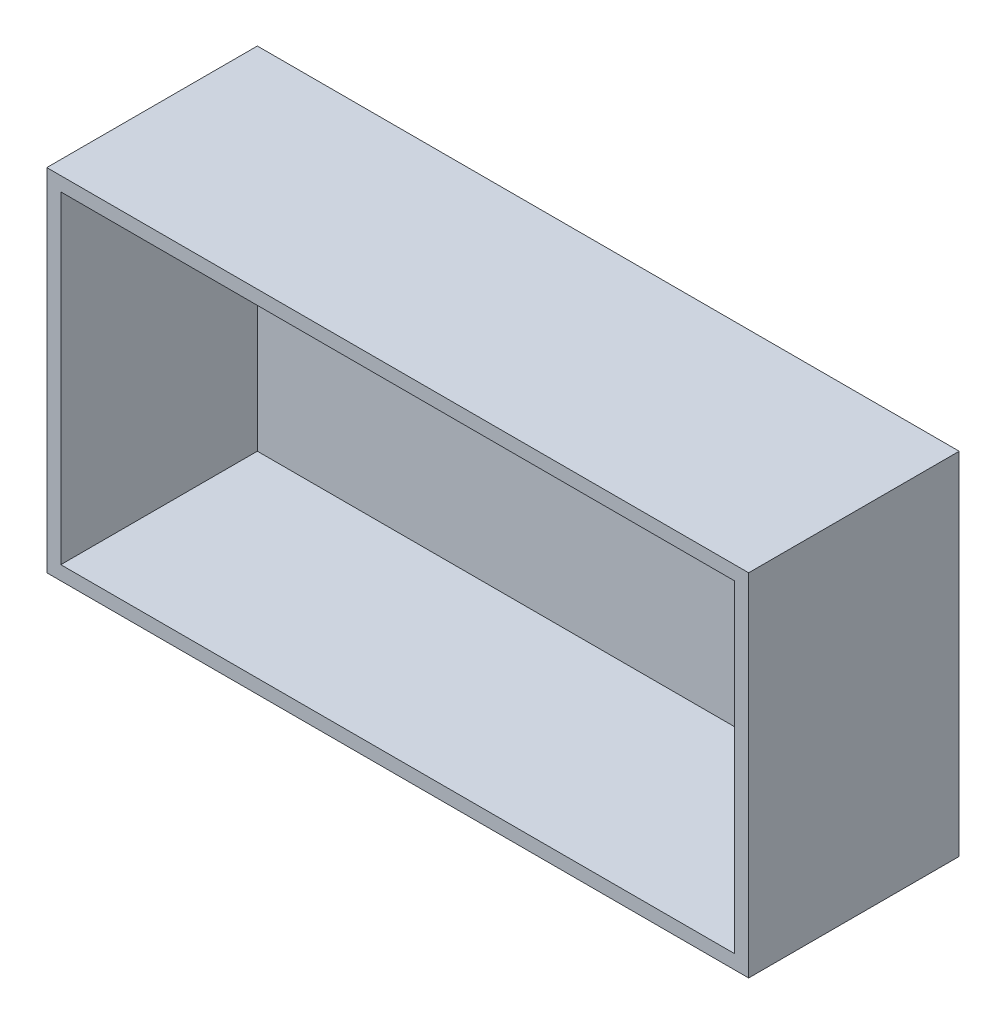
from build123d import *

# Parameters (mm, degrees)
SKETCH1_W           = 200
SKETCH1_H           = 100
BOSS_EXTRUDE1_DEPTH = 60
SHELL1_T            = -4


with BuildPart() as part:
    # Sketch1 → Boss-Extrude1 (new body)
    with BuildSketch(Plane.XY):
        Rectangle(SKETCH1_W, SKETCH1_H)
    extrude(amount=BOSS_EXTRUDE1_DEPTH)

    # Shell1
    shell1_openings = [part.faces().sort_by_distance(p)[0] for p in [
        (0, 0, 60),
    ]]
    offset(amount=SHELL1_T, openings=shell1_openings, kind=Kind.INTERSECTION)


solid = part.part
